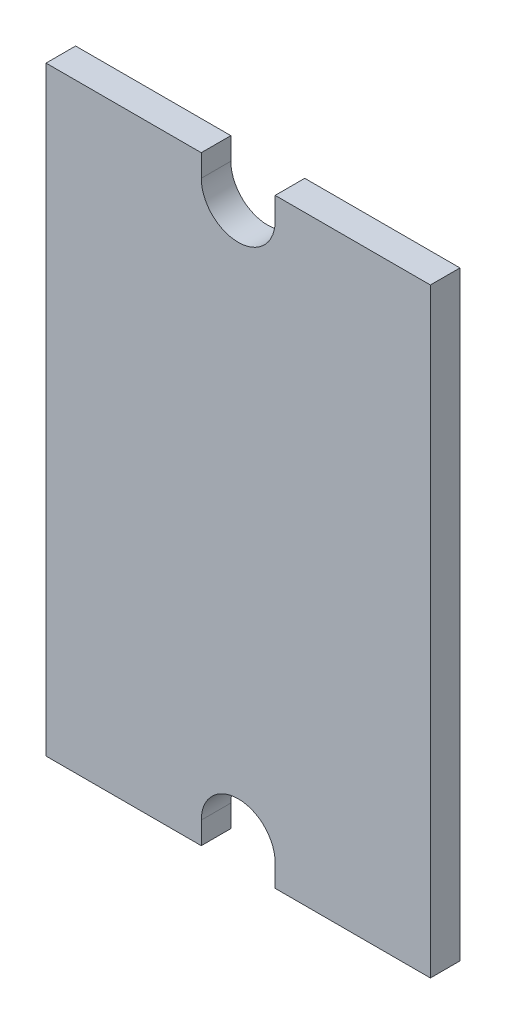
ISO-10303-21;
HEADER;
FILE_DESCRIPTION(('STEP AP214'),'2;1');
FILE_NAME('part.step','',(''),(''),'','','');
FILE_SCHEMA(('AUTOMOTIVE_DESIGN { 1 0 10303 214 1 1 1 1 }'));
ENDSEC;
DATA;
#1=APPLICATION_CONTEXT('core data for automotive mechanical design processes');
#2=APPLICATION_PROTOCOL_DEFINITION('international standard','automotive_design',2000,#1);
#3=PRODUCT_CONTEXT('',#1,'mechanical');
#4=PRODUCT('Part','Part','',(#3));
#5=PRODUCT_RELATED_PRODUCT_CATEGORY('part','',(#4));
#6=PRODUCT_DEFINITION_FORMATION('','',#4);
#7=PRODUCT_DEFINITION_CONTEXT('part definition',#1,'design');
#8=PRODUCT_DEFINITION('design','',#6,#7);
#9=PRODUCT_DEFINITION_SHAPE('','',#8);
#10=(LENGTH_UNIT() NAMED_UNIT(*) SI_UNIT(.MILLI.,.METRE.));
#11=(NAMED_UNIT(*) PLANE_ANGLE_UNIT() SI_UNIT($,.RADIAN.));
#12=(NAMED_UNIT(*) SI_UNIT($,.STERADIAN.) SOLID_ANGLE_UNIT());
#13=UNCERTAINTY_MEASURE_WITH_UNIT(LENGTH_MEASURE(1.E-05),#10,'distance_accuracy_value','');
#14=(GEOMETRIC_REPRESENTATION_CONTEXT(3) GLOBAL_UNCERTAINTY_ASSIGNED_CONTEXT((#13)) GLOBAL_UNIT_ASSIGNED_CONTEXT((#10,
#11,#12)) REPRESENTATION_CONTEXT('',''));
#15=CARTESIAN_POINT('',(0.,0.,0.));
#16=DIRECTION('',(0.,0.,1.));
#17=DIRECTION('',(1.,0.,0.));
#18=AXIS2_PLACEMENT_3D('',#15,#16,#17);
#19=CARTESIAN_POINT('',(9.,10.5,5.764));
#20=DIRECTION('',(0.,0.,-1.));
#21=DIRECTION('',(0.,-1.,0.));
#22=AXIS2_PLACEMENT_3D('',#19,#20,#21);
#23=PLANE('',#22);
#24=DIRECTION('',(1.,0.,0.));
#25=VECTOR('',#24,1.);
#26=CARTESIAN_POINT('',(2.5,11.,5.764));
#27=LINE('',#26,#25);
#28=CARTESIAN_POINT('',(2.5,11.,5.764));
#29=VERTEX_POINT('',#28);
#30=CARTESIAN_POINT('',(7.75,11.,5.764));
#31=VERTEX_POINT('',#30);
#32=EDGE_CURVE('E11',#29,#31,#27,.T.);
#33=ORIENTED_EDGE('',*,*,#32,.T.);
#34=DIRECTION('',(0.,1.,0.));
#35=VECTOR('',#34,1.);
#36=CARTESIAN_POINT('',(7.75,11.,5.764));
#37=LINE('',#36,#35);
#38=CARTESIAN_POINT('',(7.75,11.75,5.764));
#39=VERTEX_POINT('',#38);
#40=EDGE_CURVE('E27',#31,#39,#37,.T.);
#41=ORIENTED_EDGE('',*,*,#40,.T.);
#42=CARTESIAN_POINT('',(9.,11.75,5.764));
#43=DIRECTION('',(0.,0.,-1.));
#44=DIRECTION('',(1.,0.,0.));
#45=AXIS2_PLACEMENT_3D('',#42,#43,#44);
#46=CIRCLE('',#45,1.25);
#47=CARTESIAN_POINT('',(10.25,11.75,5.764));
#48=VERTEX_POINT('',#47);
#49=EDGE_CURVE('E206',#39,#48,#46,.T.);
#50=ORIENTED_EDGE('',*,*,#49,.T.);
#51=DIRECTION('',(0.,-1.,0.));
#52=VECTOR('',#51,1.);
#53=CARTESIAN_POINT('',(10.25,11.75,5.764));
#54=LINE('',#53,#52);
#55=CARTESIAN_POINT('',(10.25,11.,5.764));
#56=VERTEX_POINT('',#55);
#57=EDGE_CURVE('E202',#48,#56,#54,.T.);
#58=ORIENTED_EDGE('',*,*,#57,.T.);
#59=DIRECTION('',(1.,0.,0.));
#60=VECTOR('',#59,1.);
#61=CARTESIAN_POINT('',(6.75,11.,5.764));
#62=LINE('',#61,#60);
#63=CARTESIAN_POINT('',(15.5,11.,5.764));
#64=VERTEX_POINT('',#63);
#65=EDGE_CURVE('E207',#56,#64,#62,.T.);
#66=ORIENTED_EDGE('',*,*,#65,.T.);
#67=DIRECTION('',(0.,1.,0.));
#68=VECTOR('',#67,1.);
#69=CARTESIAN_POINT('',(15.5,15.575,5.764));
#70=LINE('',#69,#68);
#71=CARTESIAN_POINT('',(15.5,31.3,5.764));
#72=VERTEX_POINT('',#71);
#73=EDGE_CURVE('E188',#64,#72,#70,.T.);
#74=ORIENTED_EDGE('',*,*,#73,.T.);
#75=DIRECTION('',(-1.,0.,0.));
#76=VECTOR('',#75,1.);
#77=CARTESIAN_POINT('',(15.5,31.3,5.764));
#78=LINE('',#77,#76);
#79=CARTESIAN_POINT('',(10.25,31.3,5.764));
#80=VERTEX_POINT('',#79);
#81=EDGE_CURVE('E184',#72,#80,#78,.T.);
#82=ORIENTED_EDGE('',*,*,#81,.T.);
#83=DIRECTION('',(0.,-1.,0.));
#84=VECTOR('',#83,1.);
#85=CARTESIAN_POINT('',(10.25,30.55,5.764));
#86=LINE('',#85,#84);
#87=CARTESIAN_POINT('',(10.25,30.55,5.764));
#88=VERTEX_POINT('',#87);
#89=EDGE_CURVE('E167',#80,#88,#86,.T.);
#90=ORIENTED_EDGE('',*,*,#89,.T.);
#91=CARTESIAN_POINT('',(9.,30.55,5.764));
#92=DIRECTION('',(0.,0.,-1.));
#93=DIRECTION('',(-1.,0.,0.));
#94=AXIS2_PLACEMENT_3D('',#91,#92,#93);
#95=CIRCLE('',#94,1.25);
#96=CARTESIAN_POINT('',(7.75,30.55,5.764));
#97=VERTEX_POINT('',#96);
#98=EDGE_CURVE('E276',#88,#97,#95,.T.);
#99=ORIENTED_EDGE('',*,*,#98,.T.);
#100=DIRECTION('',(0.,1.,0.));
#101=VECTOR('',#100,1.);
#102=CARTESIAN_POINT('',(7.75,31.3,5.764));
#103=LINE('',#102,#101);
#104=CARTESIAN_POINT('',(7.75,31.3,5.764));
#105=VERTEX_POINT('',#104);
#106=EDGE_CURVE('E240',#97,#105,#103,.T.);
#107=ORIENTED_EDGE('',*,*,#106,.T.);
#108=DIRECTION('',(-1.,0.,0.));
#109=VECTOR('',#108,1.);
#110=CARTESIAN_POINT('',(15.5,31.3,5.764));
#111=LINE('',#110,#109);
#112=CARTESIAN_POINT('',(2.5,31.3,5.764));
#113=VERTEX_POINT('',#112);
#114=EDGE_CURVE('E236',#105,#113,#111,.T.);
#115=ORIENTED_EDGE('',*,*,#114,.T.);
#116=DIRECTION('',(0.,-1.,0.));
#117=VECTOR('',#116,1.);
#118=CARTESIAN_POINT('',(2.5,15.575,5.764));
#119=LINE('',#118,#117);
#120=EDGE_CURVE('E241',#113,#29,#119,.T.);
#121=ORIENTED_EDGE('',*,*,#120,.T.);
#122=EDGE_LOOP('',(#33,#41,#50,#58,#66,#74,#82,#90,#99,#107,#115,#121));
#123=FACE_BOUND('',#122,.T.);
#124=ADVANCED_FACE('F16',(#123),#23,.F.);
#125=CARTESIAN_POINT('',(9.,10.5,4.764));
#126=DIRECTION('',(0.,0.,-1.));
#127=DIRECTION('',(0.,-1.,0.));
#128=AXIS2_PLACEMENT_3D('',#125,#126,#127);
#129=PLANE('',#128);
#130=DIRECTION('',(-1.,0.,0.));
#131=VECTOR('',#130,1.);
#132=CARTESIAN_POINT('',(6.75,11.,4.764));
#133=LINE('',#132,#131);
#134=CARTESIAN_POINT('',(15.5,11.,4.764));
#135=VERTEX_POINT('',#134);
#136=CARTESIAN_POINT('',(10.25,11.,4.764));
#137=VERTEX_POINT('',#136);
#138=EDGE_CURVE('E226',#135,#137,#133,.T.);
#139=ORIENTED_EDGE('',*,*,#138,.T.);
#140=DIRECTION('',(0.,1.,0.));
#141=VECTOR('',#140,1.);
#142=CARTESIAN_POINT('',(10.25,11.75,4.764));
#143=LINE('',#142,#141);
#144=CARTESIAN_POINT('',(10.25,11.75,4.764));
#145=VERTEX_POINT('',#144);
#146=EDGE_CURVE('E223',#137,#145,#143,.T.);
#147=ORIENTED_EDGE('',*,*,#146,.T.);
#148=CARTESIAN_POINT('',(9.,11.75,4.764));
#149=DIRECTION('',(0.,0.,1.));
#150=DIRECTION('',(1.,0.,0.));
#151=AXIS2_PLACEMENT_3D('',#148,#149,#150);
#152=CIRCLE('',#151,1.25);
#153=CARTESIAN_POINT('',(7.75,11.75,4.764));
#154=VERTEX_POINT('',#153);
#155=EDGE_CURVE('E149',#145,#154,#152,.T.);
#156=ORIENTED_EDGE('',*,*,#155,.T.);
#157=DIRECTION('',(0.,-1.,0.));
#158=VECTOR('',#157,1.);
#159=CARTESIAN_POINT('',(7.75,11.,4.764));
#160=LINE('',#159,#158);
#161=CARTESIAN_POINT('',(7.75,11.,4.764));
#162=VERTEX_POINT('',#161);
#163=EDGE_CURVE('E142',#154,#162,#160,.T.);
#164=ORIENTED_EDGE('',*,*,#163,.T.);
#165=DIRECTION('',(-1.,0.,0.));
#166=VECTOR('',#165,1.);
#167=CARTESIAN_POINT('',(6.75,11.,4.764));
#168=LINE('',#167,#166);
#169=CARTESIAN_POINT('',(2.5,11.,4.764));
#170=VERTEX_POINT('',#169);
#171=EDGE_CURVE('E132',#162,#170,#168,.T.);
#172=ORIENTED_EDGE('',*,*,#171,.T.);
#173=DIRECTION('',(0.,1.,0.));
#174=VECTOR('',#173,1.);
#175=CARTESIAN_POINT('',(2.5,15.575,4.764));
#176=LINE('',#175,#174);
#177=CARTESIAN_POINT('',(2.5,31.3,4.764));
#178=VERTEX_POINT('',#177);
#179=EDGE_CURVE('E143',#170,#178,#176,.T.);
#180=ORIENTED_EDGE('',*,*,#179,.T.);
#181=DIRECTION('',(1.,0.,0.));
#182=VECTOR('',#181,1.);
#183=CARTESIAN_POINT('',(15.5,31.3,4.764));
#184=LINE('',#183,#182);
#185=CARTESIAN_POINT('',(7.75,31.3,4.764));
#186=VERTEX_POINT('',#185);
#187=EDGE_CURVE('E179',#178,#186,#184,.T.);
#188=ORIENTED_EDGE('',*,*,#187,.T.);
#189=DIRECTION('',(0.,-1.,0.));
#190=VECTOR('',#189,1.);
#191=CARTESIAN_POINT('',(7.75,31.3,4.764));
#192=LINE('',#191,#190);
#193=CARTESIAN_POINT('',(7.75,30.55,4.764));
#194=VERTEX_POINT('',#193);
#195=EDGE_CURVE('E183',#186,#194,#192,.T.);
#196=ORIENTED_EDGE('',*,*,#195,.T.);
#197=CARTESIAN_POINT('',(9.,30.55,4.764));
#198=DIRECTION('',(0.,0.,1.));
#199=DIRECTION('',(-1.,0.,0.));
#200=AXIS2_PLACEMENT_3D('',#197,#198,#199);
#201=CIRCLE('',#200,1.25);
#202=CARTESIAN_POINT('',(10.25,30.55,4.764));
#203=VERTEX_POINT('',#202);
#204=EDGE_CURVE('E20',#194,#203,#201,.T.);
#205=ORIENTED_EDGE('',*,*,#204,.T.);
#206=DIRECTION('',(0.,1.,0.));
#207=VECTOR('',#206,1.);
#208=CARTESIAN_POINT('',(10.25,30.55,4.764));
#209=LINE('',#208,#207);
#210=CARTESIAN_POINT('',(10.25,31.3,4.764));
#211=VERTEX_POINT('',#210);
#212=EDGE_CURVE('E197',#203,#211,#209,.T.);
#213=ORIENTED_EDGE('',*,*,#212,.T.);
#214=DIRECTION('',(1.,0.,0.));
#215=VECTOR('',#214,1.);
#216=CARTESIAN_POINT('',(15.5,31.3,4.764));
#217=LINE('',#216,#215);
#218=CARTESIAN_POINT('',(15.5,31.3,4.764));
#219=VERTEX_POINT('',#218);
#220=EDGE_CURVE('E201',#211,#219,#217,.T.);
#221=ORIENTED_EDGE('',*,*,#220,.T.);
#222=DIRECTION('',(0.,-1.,0.));
#223=VECTOR('',#222,1.);
#224=CARTESIAN_POINT('',(15.5,15.575,4.764));
#225=LINE('',#224,#223);
#226=EDGE_CURVE('E178',#219,#135,#225,.T.);
#227=ORIENTED_EDGE('',*,*,#226,.T.);
#228=EDGE_LOOP('',(#139,#147,#156,#164,#172,#180,#188,#196,#205,#213,#221,#227));
#229=FACE_BOUND('',#228,.T.);
#230=ADVANCED_FACE('F147',(#229),#129,.T.);
#231=CARTESIAN_POINT('',(10.25,11.75,4.764));
#232=DIRECTION('',(-1.,0.,0.));
#233=DIRECTION('',(0.,0.,1.));
#234=AXIS2_PLACEMENT_3D('',#231,#232,#233);
#235=PLANE('',#234);
#236=ORIENTED_EDGE('',*,*,#146,.F.);
#237=DIRECTION('',(0.,0.,1.));
#238=VECTOR('',#237,1.);
#239=CARTESIAN_POINT('',(10.25,11.,4.764));
#240=LINE('',#239,#238);
#241=EDGE_CURVE('E174',#137,#56,#240,.T.);
#242=ORIENTED_EDGE('',*,*,#241,.T.);
#243=ORIENTED_EDGE('',*,*,#57,.F.);
#244=DIRECTION('',(0.,0.,1.));
#245=VECTOR('',#244,1.);
#246=CARTESIAN_POINT('',(10.25,11.75,4.764));
#247=LINE('',#246,#245);
#248=EDGE_CURVE('E162',#145,#48,#247,.T.);
#249=ORIENTED_EDGE('',*,*,#248,.F.);
#250=EDGE_LOOP('',(#236,#242,#243,#249));
#251=FACE_BOUND('',#250,.T.);
#252=ADVANCED_FACE('F427',(#251),#235,.T.);
#253=CARTESIAN_POINT('',(9.,11.75,4.764));
#254=DIRECTION('',(0.,0.,1.));
#255=DIRECTION('',(1.,0.,0.));
#256=AXIS2_PLACEMENT_3D('',#253,#254,#255);
#257=CYLINDRICAL_SURFACE('',#256,1.25);
#258=ORIENTED_EDGE('',*,*,#155,.F.);
#259=ORIENTED_EDGE('',*,*,#248,.T.);
#260=ORIENTED_EDGE('',*,*,#49,.F.);
#261=DIRECTION('',(0.,0.,1.));
#262=VECTOR('',#261,1.);
#263=CARTESIAN_POINT('',(7.75,11.75,4.764));
#264=LINE('',#263,#262);
#265=EDGE_CURVE('E155',#154,#39,#264,.T.);
#266=ORIENTED_EDGE('',*,*,#265,.F.);
#267=EDGE_LOOP('',(#258,#259,#260,#266));
#268=FACE_BOUND('',#267,.T.);
#269=ADVANCED_FACE('F421',(#268),#257,.F.);
#270=CARTESIAN_POINT('',(7.75,11.,4.764));
#271=DIRECTION('',(1.,0.,0.));
#272=DIRECTION('',(0.,0.,1.));
#273=AXIS2_PLACEMENT_3D('',#270,#271,#272);
#274=PLANE('',#273);
#275=ORIENTED_EDGE('',*,*,#163,.F.);
#276=ORIENTED_EDGE('',*,*,#265,.T.);
#277=ORIENTED_EDGE('',*,*,#40,.F.);
#278=DIRECTION('',(0.,0.,1.));
#279=VECTOR('',#278,1.);
#280=CARTESIAN_POINT('',(7.75,11.,4.764));
#281=LINE('',#280,#279);
#282=EDGE_CURVE('E136',#162,#31,#281,.T.);
#283=ORIENTED_EDGE('',*,*,#282,.F.);
#284=EDGE_LOOP('',(#275,#276,#277,#283));
#285=FACE_BOUND('',#284,.T.);
#286=ADVANCED_FACE('F153',(#285),#274,.T.);
#287=CARTESIAN_POINT('',(2.5,11.,4.764));
#288=DIRECTION('',(0.,-1.,0.));
#289=DIRECTION('',(0.,0.,-1.));
#290=AXIS2_PLACEMENT_3D('',#287,#288,#289);
#291=PLANE('',#290);
#292=ORIENTED_EDGE('',*,*,#171,.F.);
#293=ORIENTED_EDGE('',*,*,#282,.T.);
#294=ORIENTED_EDGE('',*,*,#32,.F.);
#295=DIRECTION('',(0.,0.,1.));
#296=VECTOR('',#295,1.);
#297=CARTESIAN_POINT('',(2.5,11.,4.764));
#298=LINE('',#297,#296);
#299=EDGE_CURVE('E138',#170,#29,#298,.T.);
#300=ORIENTED_EDGE('',*,*,#299,.F.);
#301=EDGE_LOOP('',(#292,#293,#294,#300));
#302=FACE_BOUND('',#301,.T.);
#303=ADVANCED_FACE('F134',(#302),#291,.T.);
#304=CARTESIAN_POINT('',(2.5,31.3,4.764));
#305=DIRECTION('',(-1.,0.,0.));
#306=DIRECTION('',(0.,0.,1.));
#307=AXIS2_PLACEMENT_3D('',#304,#305,#306);
#308=PLANE('',#307);
#309=ORIENTED_EDGE('',*,*,#179,.F.);
#310=ORIENTED_EDGE('',*,*,#299,.T.);
#311=ORIENTED_EDGE('',*,*,#120,.F.);
#312=DIRECTION('',(0.,0.,1.));
#313=VECTOR('',#312,1.);
#314=CARTESIAN_POINT('',(2.5,31.3,4.764));
#315=LINE('',#314,#313);
#316=EDGE_CURVE('E164',#178,#113,#315,.T.);
#317=ORIENTED_EDGE('',*,*,#316,.F.);
#318=EDGE_LOOP('',(#309,#310,#311,#317));
#319=FACE_BOUND('',#318,.T.);
#320=ADVANCED_FACE('F252',(#319),#308,.T.);
#321=CARTESIAN_POINT('',(7.75,31.3,4.764));
#322=DIRECTION('',(0.,1.,0.));
#323=DIRECTION('',(1.,0.,0.));
#324=AXIS2_PLACEMENT_3D('',#321,#322,#323);
#325=PLANE('',#324);
#326=ORIENTED_EDGE('',*,*,#187,.F.);
#327=ORIENTED_EDGE('',*,*,#316,.T.);
#328=ORIENTED_EDGE('',*,*,#114,.F.);
#329=DIRECTION('',(0.,0.,1.));
#330=VECTOR('',#329,1.);
#331=CARTESIAN_POINT('',(7.75,31.3,4.764));
#332=LINE('',#331,#330);
#333=EDGE_CURVE('E173',#186,#105,#332,.T.);
#334=ORIENTED_EDGE('',*,*,#333,.F.);
#335=EDGE_LOOP('',(#326,#327,#328,#334));
#336=FACE_BOUND('',#335,.T.);
#337=ADVANCED_FACE('F254',(#336),#325,.T.);
#338=CARTESIAN_POINT('',(7.75,30.55,4.764));
#339=DIRECTION('',(1.,0.,0.));
#340=DIRECTION('',(0.,1.,0.));
#341=AXIS2_PLACEMENT_3D('',#338,#339,#340);
#342=PLANE('',#341);
#343=ORIENTED_EDGE('',*,*,#195,.F.);
#344=ORIENTED_EDGE('',*,*,#333,.T.);
#345=ORIENTED_EDGE('',*,*,#106,.F.);
#346=DIRECTION('',(0.,0.,1.));
#347=VECTOR('',#346,1.);
#348=CARTESIAN_POINT('',(7.75,30.55,4.764));
#349=LINE('',#348,#347);
#350=EDGE_CURVE('E208',#194,#97,#349,.T.);
#351=ORIENTED_EDGE('',*,*,#350,.F.);
#352=EDGE_LOOP('',(#343,#344,#345,#351));
#353=FACE_BOUND('',#352,.T.);
#354=ADVANCED_FACE('F258',(#353),#342,.T.);
#355=CARTESIAN_POINT('',(9.,30.55,4.764));
#356=DIRECTION('',(0.,0.,1.));
#357=DIRECTION('',(-1.,0.,0.));
#358=AXIS2_PLACEMENT_3D('',#355,#356,#357);
#359=CYLINDRICAL_SURFACE('',#358,1.25);
#360=ORIENTED_EDGE('',*,*,#204,.F.);
#361=ORIENTED_EDGE('',*,*,#350,.T.);
#362=ORIENTED_EDGE('',*,*,#98,.F.);
#363=DIRECTION('',(0.,0.,1.));
#364=VECTOR('',#363,1.);
#365=CARTESIAN_POINT('',(10.25,30.55,4.764));
#366=LINE('',#365,#364);
#367=EDGE_CURVE('E212',#203,#88,#366,.T.);
#368=ORIENTED_EDGE('',*,*,#367,.F.);
#369=EDGE_LOOP('',(#360,#361,#362,#368));
#370=FACE_BOUND('',#369,.T.);
#371=ADVANCED_FACE('F289',(#370),#359,.F.);
#372=CARTESIAN_POINT('',(10.25,31.3,4.764));
#373=DIRECTION('',(-1.,0.,0.));
#374=DIRECTION('',(0.,1.,0.));
#375=AXIS2_PLACEMENT_3D('',#372,#373,#374);
#376=PLANE('',#375);
#377=ORIENTED_EDGE('',*,*,#212,.F.);
#378=ORIENTED_EDGE('',*,*,#367,.T.);
#379=ORIENTED_EDGE('',*,*,#89,.F.);
#380=DIRECTION('',(0.,0.,1.));
#381=VECTOR('',#380,1.);
#382=CARTESIAN_POINT('',(10.25,31.3,4.764));
#383=LINE('',#382,#381);
#384=EDGE_CURVE('E216',#211,#80,#383,.T.);
#385=ORIENTED_EDGE('',*,*,#384,.F.);
#386=EDGE_LOOP('',(#377,#378,#379,#385));
#387=FACE_BOUND('',#386,.T.);
#388=ADVANCED_FACE('F18',(#387),#376,.T.);
#389=CARTESIAN_POINT('',(15.5,31.3,4.764));
#390=DIRECTION('',(0.,1.,0.));
#391=DIRECTION('',(1.,0.,0.));
#392=AXIS2_PLACEMENT_3D('',#389,#390,#391);
#393=PLANE('',#392);
#394=ORIENTED_EDGE('',*,*,#220,.F.);
#395=ORIENTED_EDGE('',*,*,#384,.T.);
#396=ORIENTED_EDGE('',*,*,#81,.F.);
#397=DIRECTION('',(0.,0.,1.));
#398=VECTOR('',#397,1.);
#399=CARTESIAN_POINT('',(15.5,31.3,4.764));
#400=LINE('',#399,#398);
#401=EDGE_CURVE('E195',#219,#72,#400,.T.);
#402=ORIENTED_EDGE('',*,*,#401,.F.);
#403=EDGE_LOOP('',(#394,#395,#396,#402));
#404=FACE_BOUND('',#403,.T.);
#405=ADVANCED_FACE('F406',(#404),#393,.T.);
#406=CARTESIAN_POINT('',(15.5,11.,4.764));
#407=DIRECTION('',(1.,0.,0.));
#408=DIRECTION('',(0.,1.,0.));
#409=AXIS2_PLACEMENT_3D('',#406,#407,#408);
#410=PLANE('',#409);
#411=ORIENTED_EDGE('',*,*,#226,.F.);
#412=ORIENTED_EDGE('',*,*,#401,.T.);
#413=ORIENTED_EDGE('',*,*,#73,.F.);
#414=DIRECTION('',(0.,0.,1.));
#415=VECTOR('',#414,1.);
#416=CARTESIAN_POINT('',(15.5,11.,4.764));
#417=LINE('',#416,#415);
#418=EDGE_CURVE('E192',#135,#64,#417,.T.);
#419=ORIENTED_EDGE('',*,*,#418,.F.);
#420=EDGE_LOOP('',(#411,#412,#413,#419));
#421=FACE_BOUND('',#420,.T.);
#422=ADVANCED_FACE('F411',(#421),#410,.T.);
#423=CARTESIAN_POINT('',(13.5,11.,4.764));
#424=DIRECTION('',(0.,-1.,0.));
#425=DIRECTION('',(0.,0.,-1.));
#426=AXIS2_PLACEMENT_3D('',#423,#424,#425);
#427=PLANE('',#426);
#428=ORIENTED_EDGE('',*,*,#138,.F.);
#429=ORIENTED_EDGE('',*,*,#418,.T.);
#430=ORIENTED_EDGE('',*,*,#65,.F.);
#431=ORIENTED_EDGE('',*,*,#241,.F.);
#432=EDGE_LOOP('',(#428,#429,#430,#431));
#433=FACE_BOUND('',#432,.T.);
#434=ADVANCED_FACE('F444',(#433),#427,.T.);
#435=CLOSED_SHELL('',(#124,#230,#252,#269,#286,#303,#320,#337,#354,#371,#388,#405,#422,#434));
#436=MANIFOLD_SOLID_BREP('B1',#435);
#437=ADVANCED_BREP_SHAPE_REPRESENTATION('',(#18,#436),#14);
#438=SHAPE_DEFINITION_REPRESENTATION(#9,#437);
ENDSEC;
END-ISO-10303-21;
